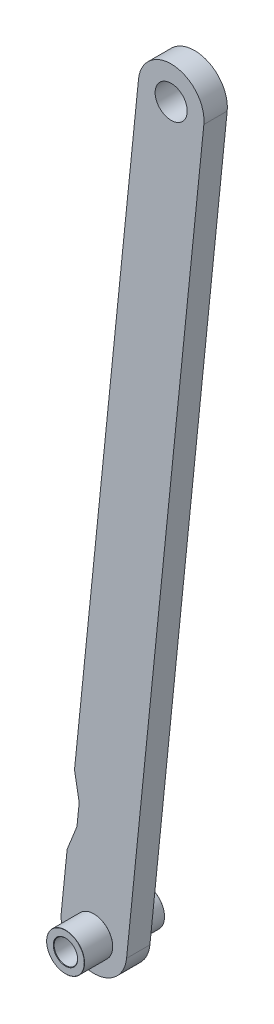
ISO-10303-21;
HEADER;
FILE_DESCRIPTION(('STEP AP214'),'2;1');
FILE_NAME('part.step','',(''),(''),'','','');
FILE_SCHEMA(('AUTOMOTIVE_DESIGN { 1 0 10303 214 1 1 1 1 }'));
ENDSEC;
DATA;
#1=APPLICATION_CONTEXT('core data for automotive mechanical design processes');
#2=APPLICATION_PROTOCOL_DEFINITION('international standard','automotive_design',2000,#1);
#3=PRODUCT_CONTEXT('',#1,'mechanical');
#4=PRODUCT('Part','Part','',(#3));
#5=PRODUCT_RELATED_PRODUCT_CATEGORY('part','',(#4));
#6=PRODUCT_DEFINITION_FORMATION('','',#4);
#7=PRODUCT_DEFINITION_CONTEXT('part definition',#1,'design');
#8=PRODUCT_DEFINITION('design','',#6,#7);
#9=PRODUCT_DEFINITION_SHAPE('','',#8);
#10=(LENGTH_UNIT() NAMED_UNIT(*) SI_UNIT(.MILLI.,.METRE.));
#11=(NAMED_UNIT(*) PLANE_ANGLE_UNIT() SI_UNIT($,.RADIAN.));
#12=(NAMED_UNIT(*) SI_UNIT($,.STERADIAN.) SOLID_ANGLE_UNIT());
#13=UNCERTAINTY_MEASURE_WITH_UNIT(LENGTH_MEASURE(1.E-05),#10,'distance_accuracy_value','');
#14=(GEOMETRIC_REPRESENTATION_CONTEXT(3) GLOBAL_UNCERTAINTY_ASSIGNED_CONTEXT((#13)) GLOBAL_UNIT_ASSIGNED_CONTEXT((#10,
#11,#12)) REPRESENTATION_CONTEXT('',''));
#15=CARTESIAN_POINT('',(0.,0.,0.));
#16=DIRECTION('',(0.,0.,1.));
#17=DIRECTION('',(1.,0.,0.));
#18=AXIS2_PLACEMENT_3D('',#15,#16,#17);
#19=CARTESIAN_POINT('',(118.610253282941,-532.968700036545,-27.5000000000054));
#20=DIRECTION('',(0.,0.,-1.));
#21=DIRECTION('',(-0.0840710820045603,0.996459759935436,0.));
#22=AXIS2_PLACEMENT_3D('',#19,#20,#21);
#23=PLANE('',#22);
#24=CARTESIAN_POINT('',(118.610253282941,-532.968700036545,-27.5000000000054));
#25=DIRECTION('',(0.,0.,-1.));
#26=DIRECTION('',(-0.0840710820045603,0.996459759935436,0.));
#27=AXIS2_PLACEMENT_3D('',#24,#25,#26);
#28=CIRCLE('',#27,12.9);
#29=CARTESIAN_POINT('',(117.525736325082,-520.114369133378,-27.5000000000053));
#30=VERTEX_POINT('',#29);
#31=EDGE_CURVE('P0_E10',#30,#30,#28,.T.);
#32=ORIENTED_EDGE('',*,*,#31,.T.);
#33=EDGE_LOOP('',(#32));
#34=FACE_BOUND('',#33,.T.);
#35=CARTESIAN_POINT('',(118.610253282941,-532.968700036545,-27.5000000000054));
#36=DIRECTION('',(0.,0.,-1.));
#37=DIRECTION('',(-0.0840710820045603,0.996459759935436,0.));
#38=AXIS2_PLACEMENT_3D('',#35,#36,#37);
#39=CIRCLE('',#38,8.35);
#40=CARTESIAN_POINT('',(117.908259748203,-524.648261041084,-27.5000000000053));
#41=VERTEX_POINT('',#40);
#42=EDGE_CURVE('P0_E34',#41,#41,#39,.F.);
#43=ORIENTED_EDGE('',*,*,#42,.T.);
#44=EDGE_LOOP('',(#43));
#45=FACE_BOUND('',#44,.T.);
#46=ADVANCED_FACE('P0_F14',(#34,#45),#23,.T.);
#47=CARTESIAN_POINT('',(118.610253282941,-532.968700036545,-8.0000000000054));
#48=DIRECTION('',(0.,0.,-1.));
#49=DIRECTION('',(-0.0840710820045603,0.996459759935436,0.));
#50=AXIS2_PLACEMENT_3D('',#47,#48,#49);
#51=PLANE('',#50);
#52=CARTESIAN_POINT('',(118.610253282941,-532.968700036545,-8.0000000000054));
#53=DIRECTION('',(0.,0.,-1.));
#54=DIRECTION('',(-0.0840710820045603,0.996459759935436,0.));
#55=AXIS2_PLACEMENT_3D('',#52,#53,#54);
#56=CIRCLE('',#55,12.9);
#57=CARTESIAN_POINT('',(117.525736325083,-520.114369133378,-8.0000000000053));
#58=VERTEX_POINT('',#57);
#59=EDGE_CURVE('P0_E21',#58,#58,#56,.F.);
#60=ORIENTED_EDGE('',*,*,#59,.T.);
#61=EDGE_LOOP('',(#60));
#62=FACE_BOUND('',#61,.T.);
#63=CARTESIAN_POINT('',(118.610253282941,-532.968700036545,-8.0000000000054));
#64=DIRECTION('',(0.,0.,-1.));
#65=DIRECTION('',(-0.0840710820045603,0.996459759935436,0.));
#66=AXIS2_PLACEMENT_3D('',#63,#64,#65);
#67=CIRCLE('',#66,8.35);
#68=CARTESIAN_POINT('',(119.31224681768,-541.289139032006,-8.00000000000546));
#69=VERTEX_POINT('',#68);
#70=EDGE_CURVE('P0_E43',#69,#69,#67,.T.);
#71=ORIENTED_EDGE('',*,*,#70,.T.);
#72=EDGE_LOOP('',(#71));
#73=FACE_BOUND('',#72,.T.);
#74=ADVANCED_FACE('P0_F47',(#62,#73),#51,.F.);
#75=CARTESIAN_POINT('',(118.610253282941,-532.968700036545,-27.5000000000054));
#76=DIRECTION('',(0.,0.,1.));
#77=DIRECTION('',(0.0840710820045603,-0.996459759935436,0.));
#78=AXIS2_PLACEMENT_3D('',#75,#76,#77);
#79=CYLINDRICAL_SURFACE('',#78,13.);
#80=CARTESIAN_POINT('',(118.610253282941,-532.968700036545,-8.1000000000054));
#81=DIRECTION('',(0.,0.,-1.));
#82=DIRECTION('',(-0.0840710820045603,0.996459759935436,0.));
#83=AXIS2_PLACEMENT_3D('',#80,#81,#82);
#84=CIRCLE('',#83,13.);
#85=CARTESIAN_POINT('',(117.517329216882,-520.014723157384,-8.1000000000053));
#86=VERTEX_POINT('',#85);
#87=EDGE_CURVE('P0_E25',#86,#86,#84,.T.);
#88=ORIENTED_EDGE('',*,*,#87,.T.);
#89=EDGE_LOOP('',(#88));
#90=FACE_BOUND('',#89,.T.);
#91=CARTESIAN_POINT('',(118.610253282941,-532.968700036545,-27.4000000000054));
#92=DIRECTION('',(0.,0.,-1.));
#93=DIRECTION('',(-0.0840710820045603,0.996459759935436,0.));
#94=AXIS2_PLACEMENT_3D('',#91,#92,#93);
#95=CIRCLE('',#94,13.);
#96=CARTESIAN_POINT('',(117.517329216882,-520.014723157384,-27.4000000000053));
#97=VERTEX_POINT('',#96);
#98=EDGE_CURVE('P0_E29',#97,#97,#95,.F.);
#99=ORIENTED_EDGE('',*,*,#98,.T.);
#100=EDGE_LOOP('',(#99));
#101=FACE_BOUND('',#100,.T.);
#102=ADVANCED_FACE('P0_F63',(#90,#101),#79,.T.);
#103=CARTESIAN_POINT('',(118.610253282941,-532.968700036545,-27.5000000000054));
#104=DIRECTION('',(0.,0.,1.));
#105=DIRECTION('',(0.0840710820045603,-0.996459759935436,0.));
#106=AXIS2_PLACEMENT_3D('',#103,#104,#105);
#107=CYLINDRICAL_SURFACE('',#106,8.05);
#108=CARTESIAN_POINT('',(118.610253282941,-532.968700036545,-8.3000000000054));
#109=DIRECTION('',(0.,0.,-1.));
#110=DIRECTION('',(-0.0840710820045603,0.996459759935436,0.));
#111=AXIS2_PLACEMENT_3D('',#108,#109,#110);
#112=CIRCLE('',#111,8.05);
#113=CARTESIAN_POINT('',(119.287025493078,-540.990201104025,-8.30000000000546));
#114=VERTEX_POINT('',#113);
#115=EDGE_CURVE('P0_E37',#114,#114,#112,.F.);
#116=ORIENTED_EDGE('',*,*,#115,.T.);
#117=EDGE_LOOP('',(#116));
#118=FACE_BOUND('',#117,.T.);
#119=CARTESIAN_POINT('',(118.610253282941,-532.968700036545,-27.2000000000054));
#120=DIRECTION('',(0.,0.,-1.));
#121=DIRECTION('',(-0.0840710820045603,0.996459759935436,0.));
#122=AXIS2_PLACEMENT_3D('',#119,#120,#121);
#123=CIRCLE('',#122,8.05);
#124=CARTESIAN_POINT('',(117.933481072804,-524.947198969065,-27.2000000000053));
#125=VERTEX_POINT('',#124);
#126=EDGE_CURVE('P0_E40',#125,#125,#123,.T.);
#127=ORIENTED_EDGE('',*,*,#126,.T.);
#128=EDGE_LOOP('',(#127));
#129=FACE_BOUND('',#128,.T.);
#130=ADVANCED_FACE('P0_F52',(#118,#129),#107,.F.);
#131=CARTESIAN_POINT('',(118.610253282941,-532.968700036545,-8.0000000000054));
#132=DIRECTION('',(0.,0.,1.));
#133=DIRECTION('',(0.0840710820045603,-0.996459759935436,0.));
#134=AXIS2_PLACEMENT_3D('',#131,#132,#133);
#135=CONICAL_SURFACE('',#134,8.35,0.785398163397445);
#136=CARTESIAN_POINT('',(119.287025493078,-540.990201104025,-8.30000000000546));
#137=CARTESIAN_POINT('',(119.287288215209,-540.993315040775,-8.29687500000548));
#138=CARTESIAN_POINT('',(119.287550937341,-540.996428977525,-8.29375000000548));
#139=CARTESIAN_POINT('',(119.288076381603,-541.002656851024,-8.28750000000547));
#140=CARTESIAN_POINT('',(119.288339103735,-541.005770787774,-8.28437500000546));
#141=CARTESIAN_POINT('',(119.288864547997,-541.011998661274,-8.27812500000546));
#142=CARTESIAN_POINT('',(119.289127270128,-541.015112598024,-8.27500000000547));
#143=CARTESIAN_POINT('',(119.289652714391,-541.021340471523,-8.26875000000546));
#144=CARTESIAN_POINT('',(119.289915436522,-541.024454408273,-8.26562500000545));
#145=CARTESIAN_POINT('',(119.290440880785,-541.030682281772,-8.25937500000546));
#146=CARTESIAN_POINT('',(119.290703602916,-541.033796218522,-8.25625000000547));
#147=CARTESIAN_POINT('',(119.291229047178,-541.040024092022,-8.25000000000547));
#148=CARTESIAN_POINT('',(119.29149176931,-541.043138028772,-8.24687500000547));
#149=CARTESIAN_POINT('',(119.292017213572,-541.049365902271,-8.24062500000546));
#150=CARTESIAN_POINT('',(119.292279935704,-541.052479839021,-8.23750000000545));
#151=CARTESIAN_POINT('',(119.292805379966,-541.058707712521,-8.23125000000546));
#152=CARTESIAN_POINT('',(119.293068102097,-541.061821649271,-8.22812500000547));
#153=CARTESIAN_POINT('',(119.29359354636,-541.06804952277,-8.22187500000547));
#154=CARTESIAN_POINT('',(119.293856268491,-541.07116345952,-8.21875000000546));
#155=CARTESIAN_POINT('',(119.294381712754,-541.077391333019,-8.21250000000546));
#156=CARTESIAN_POINT('',(119.294644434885,-541.080505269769,-8.20937500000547));
#157=CARTESIAN_POINT('',(119.295169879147,-541.086733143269,-8.20312500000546));
#158=CARTESIAN_POINT('',(119.295432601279,-541.089847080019,-8.20000000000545));
#159=CARTESIAN_POINT('',(119.295958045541,-541.096074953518,-8.19375000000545));
#160=CARTESIAN_POINT('',(119.296220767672,-541.099188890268,-8.19062500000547));
#161=CARTESIAN_POINT('',(119.296746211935,-541.105416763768,-8.18437500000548));
#162=CARTESIAN_POINT('',(119.297008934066,-541.108530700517,-8.18125000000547));
#163=CARTESIAN_POINT('',(119.297534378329,-541.114758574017,-8.17500000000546));
#164=CARTESIAN_POINT('',(119.29779710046,-541.117872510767,-8.17187500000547));
#165=CARTESIAN_POINT('',(119.298322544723,-541.124100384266,-8.16562500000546));
#166=CARTESIAN_POINT('',(119.298585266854,-541.127214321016,-8.16250000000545));
#167=CARTESIAN_POINT('',(119.299110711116,-541.133442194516,-8.15625000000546));
#168=CARTESIAN_POINT('',(119.299373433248,-541.136556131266,-8.15312500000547));
#169=CARTESIAN_POINT('',(119.29989887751,-541.142784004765,-8.14687500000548));
#170=CARTESIAN_POINT('',(119.300161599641,-541.145897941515,-8.14375000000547));
#171=CARTESIAN_POINT('',(119.300687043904,-541.152125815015,-8.13750000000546));
#172=CARTESIAN_POINT('',(119.300949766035,-541.155239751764,-8.13437500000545));
#173=CARTESIAN_POINT('',(119.301475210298,-541.161467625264,-8.12812500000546));
#174=CARTESIAN_POINT('',(119.301737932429,-541.164581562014,-8.12500000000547));
#175=CARTESIAN_POINT('',(119.302263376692,-541.170809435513,-8.11875000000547));
#176=CARTESIAN_POINT('',(119.302526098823,-541.173923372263,-8.11562500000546));
#177=CARTESIAN_POINT('',(119.303051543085,-541.180151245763,-8.10937500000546));
#178=CARTESIAN_POINT('',(119.303314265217,-541.183265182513,-8.10625000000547));
#179=CARTESIAN_POINT('',(119.303839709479,-541.189493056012,-8.10000000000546));
#180=CARTESIAN_POINT('',(119.30410243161,-541.192606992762,-8.09687500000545));
#181=CARTESIAN_POINT('',(119.304627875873,-541.198834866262,-8.09062500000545));
#182=CARTESIAN_POINT('',(119.304890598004,-541.201948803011,-8.08750000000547));
#183=CARTESIAN_POINT('',(119.305416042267,-541.208176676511,-8.08125000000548));
#184=CARTESIAN_POINT('',(119.305678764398,-541.211290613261,-8.07812500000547));
#185=CARTESIAN_POINT('',(119.306204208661,-541.21751848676,-8.07187500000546));
#186=CARTESIAN_POINT('',(119.306466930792,-541.22063242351,-8.06875000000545));
#187=CARTESIAN_POINT('',(119.306992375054,-541.22686029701,-8.06250000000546));
#188=CARTESIAN_POINT('',(119.307255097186,-541.22997423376,-8.05937500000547));
#189=CARTESIAN_POINT('',(119.307780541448,-541.236202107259,-8.05312500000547));
#190=CARTESIAN_POINT('',(119.308043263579,-541.239316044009,-8.05000000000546));
#191=CARTESIAN_POINT('',(119.308568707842,-541.245543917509,-8.04375000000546));
#192=CARTESIAN_POINT('',(119.308831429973,-541.248657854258,-8.04062500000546));
#193=CARTESIAN_POINT('',(119.309356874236,-541.254885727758,-8.03437500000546));
#194=CARTESIAN_POINT('',(119.309619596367,-541.257999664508,-8.03125000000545));
#195=CARTESIAN_POINT('',(119.310145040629,-541.264227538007,-8.02500000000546));
#196=CARTESIAN_POINT('',(119.310407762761,-541.267341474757,-8.02187500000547));
#197=CARTESIAN_POINT('',(119.310933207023,-541.273569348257,-8.01562500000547));
#198=CARTESIAN_POINT('',(119.311195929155,-541.276683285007,-8.01250000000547));
#199=CARTESIAN_POINT('',(119.311721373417,-541.282911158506,-8.00625000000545));
#200=CARTESIAN_POINT('',(119.311984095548,-541.286025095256,-8.00312500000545));
#201=CARTESIAN_POINT('',(119.31224681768,-541.289139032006,-8.00000000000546));
#202=B_SPLINE_CURVE_WITH_KNOTS('',3,(#136,#137,#138,#139,#140,#141,#142,#143,#144,#145,#146,
#147,#148,#149,#150,#151,#152,#153,#154,#155,#156,#157,#158,#159,#160,#161,#162,#163,#164,#165,
#166,#167,#168,#169,#170,#171,#172,#173,#174,#175,#176,#177,#178,#179,#180,#181,#182,#183,#184,
#185,#186,#187,#188,#189,#190,#191,#192,#193,#194,#195,#196,#197,#198,#199,#200,#201),
.UNSPECIFIED.,.F.,.F.,(4,2,2,2,2,2,2,2,2,2,2,2,2,2,2,2,2,2,2,2,2,2,2,2,2,2,2,2,2,2,2,2,4),(0.,
0.0132582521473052,0.0265165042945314,0.0397747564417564,0.0530330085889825,0.0662912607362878,
0.0795495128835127,0.0928077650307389,0.106066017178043,0.119324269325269,0.132582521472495,
0.145840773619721,0.159099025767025,0.17235727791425,0.185615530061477,0.198873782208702,
0.212132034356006,0.225390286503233,0.238648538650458,0.251906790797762,0.265165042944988,
0.278423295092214,0.29168154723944,0.304939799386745,0.31819805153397,0.331456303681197,
0.344714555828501,0.357972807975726,0.371231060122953,0.384489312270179,0.397747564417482,
0.411005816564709,0.424264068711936),.UNSPECIFIED.);
#203=EDGE_CURVE('P0_BSEAM49',#114,#69,#202,.T.);
#204=ORIENTED_EDGE('',*,*,#115,.F.);
#205=ORIENTED_EDGE('',*,*,#70,.F.);
#206=ORIENTED_EDGE('',*,*,#203,.T.);
#207=ORIENTED_EDGE('',*,*,#203,.F.);
#208=EDGE_LOOP('',(#204,#206,#205,#207));
#209=FACE_BOUND('',#208,.T.);
#210=ADVANCED_FACE('P0_F49',(#209),#135,.F.);
#211=CARTESIAN_POINT('',(118.610253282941,-532.968700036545,-27.2000000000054));
#212=DIRECTION('',(0.,0.,-1.));
#213=DIRECTION('',(-0.0840710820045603,0.996459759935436,0.));
#214=AXIS2_PLACEMENT_3D('',#211,#212,#213);
#215=CONICAL_SURFACE('',#214,8.05,0.785398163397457);
#216=ORIENTED_EDGE('',*,*,#42,.F.);
#217=EDGE_LOOP('',(#216));
#218=FACE_BOUND('',#217,.T.);
#219=ORIENTED_EDGE('',*,*,#126,.F.);
#220=EDGE_LOOP('',(#219));
#221=FACE_BOUND('',#220,.T.);
#222=ADVANCED_FACE('P0_F51',(#218,#221),#215,.F.);
#223=CARTESIAN_POINT('',(118.610253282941,-532.968700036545,-8.1000000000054));
#224=DIRECTION('',(0.,0.,-1.));
#225=DIRECTION('',(-0.0840710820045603,0.996459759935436,0.));
#226=AXIS2_PLACEMENT_3D('',#223,#224,#225);
#227=CONICAL_SURFACE('',#226,13.,0.785398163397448);
#228=ORIENTED_EDGE('',*,*,#59,.F.);
#229=EDGE_LOOP('',(#228));
#230=FACE_BOUND('',#229,.T.);
#231=ORIENTED_EDGE('',*,*,#87,.F.);
#232=EDGE_LOOP('',(#231));
#233=FACE_BOUND('',#232,.T.);
#234=ADVANCED_FACE('P0_F60',(#230,#233),#227,.T.);
#235=CARTESIAN_POINT('',(118.610253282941,-532.968700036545,-27.5000000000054));
#236=DIRECTION('',(0.,0.,1.));
#237=DIRECTION('',(0.0840710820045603,-0.996459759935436,0.));
#238=AXIS2_PLACEMENT_3D('',#235,#236,#237);
#239=CONICAL_SURFACE('',#238,12.9,0.785398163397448);
#240=ORIENTED_EDGE('',*,*,#98,.F.);
#241=EDGE_LOOP('',(#240));
#242=FACE_BOUND('',#241,.T.);
#243=ORIENTED_EDGE('',*,*,#31,.F.);
#244=EDGE_LOOP('',(#243));
#245=FACE_BOUND('',#244,.T.);
#246=ADVANCED_FACE('P0_F16',(#242,#245),#239,.T.);
#247=CLOSED_SHELL('',(#46,#74,#102,#130,#210,#222,#234,#246));
#248=MANIFOLD_SOLID_BREP('P0_B1',#247);
#249=CARTESIAN_POINT('',(171.564170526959,-11.651251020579,-8.00000000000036));
#250=DIRECTION('',(0.,0.,-1.));
#251=DIRECTION('',(-0.101057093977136,-0.994880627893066,0.));
#252=AXIS2_PLACEMENT_3D('',#249,#250,#251);
#253=PLANE('',#252);
#254=CARTESIAN_POINT('',(118.61025328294,-532.968700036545,-8.00000000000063));
#255=DIRECTION('',(0.,0.,-1.));
#256=DIRECTION('',(-0.101057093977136,-0.994880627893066,0.));
#257=AXIS2_PLACEMENT_3D('',#254,#255,#256);
#258=CIRCLE('',#257,11.);
#259=CARTESIAN_POINT('',(117.498625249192,-543.912386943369,-8.00000000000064));
#260=VERTEX_POINT('',#259);
#261=EDGE_CURVE('P1_E142',#260,#260,#258,.T.);
#262=ORIENTED_EDGE('',*,*,#261,.F.);
#263=EDGE_LOOP('',(#262));
#264=FACE_BOUND('',#263,.T.);
#265=CARTESIAN_POINT('',(171.564170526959,-11.651251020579,-8.00000000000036));
#266=DIRECTION('',(0.,0.,-1.));
#267=DIRECTION('',(-0.101057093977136,-0.994880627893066,0.));
#268=AXIS2_PLACEMENT_3D('',#265,#266,#267);
#269=CIRCLE('',#268,11.);
#270=CARTESIAN_POINT('',(170.452542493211,-22.5949379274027,-8.00000000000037));
#271=VERTEX_POINT('',#270);
#272=EDGE_CURVE('P1_E136',#271,#271,#269,.T.);
#273=ORIENTED_EDGE('',*,*,#272,.F.);
#274=EDGE_LOOP('',(#273));
#275=FACE_BOUND('',#274,.T.);
#276=DIRECTION('',(0.101057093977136,0.994880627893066,0.));
#277=VECTOR('',#276,1.);
#278=CARTESIAN_POINT('',(149.179356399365,-9.37746640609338,-8.00000000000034));
#279=LINE('',#278,#277);
#280=CARTESIAN_POINT('',(96.2254391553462,-530.69491542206,-8.00000000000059));
#281=VERTEX_POINT('',#280);
#282=CARTESIAN_POINT('',(100.267722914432,-490.899690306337,-8.00000000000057));
#283=VERTEX_POINT('',#282);
#284=EDGE_CURVE('P1_E115',#281,#283,#279,.T.);
#285=ORIENTED_EDGE('',*,*,#284,.T.);
#286=DIRECTION('',(0.37048354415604,0.928839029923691,0.));
#287=VECTOR('',#286,1.);
#288=CARTESIAN_POINT('',(274.972504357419,-52.8974570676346,-8.00000000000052));
#289=LINE('',#288,#287);
#290=CARTESIAN_POINT('',(107.010625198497,-473.994564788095,-8.00000000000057));
#291=VERTEX_POINT('',#290);
#292=EDGE_CURVE('P1_E31',#283,#291,#289,.T.);
#293=ORIENTED_EDGE('',*,*,#292,.T.);
#294=DIRECTION('',(0.101057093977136,0.994880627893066,0.));
#295=VECTOR('',#294,1.);
#296=CARTESIAN_POINT('',(154.153759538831,-9.88275187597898,-8.00000000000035));
#297=LINE('',#296,#295);
#298=CARTESIAN_POINT('',(108.526481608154,-459.071355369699,-8.00000000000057));
#299=VERTEX_POINT('',#298);
#300=EDGE_CURVE('P1_E35',#291,#299,#297,.T.);
#301=ORIENTED_EDGE('',*,*,#300,.T.);
#302=DIRECTION('',(-0.17614591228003,0.984364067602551,0.));
#303=VECTOR('',#302,1.);
#304=CARTESIAN_POINT('',(32.9034405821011,-36.4637381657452,-8.0000000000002));
#305=LINE('',#304,#303);
#306=CARTESIAN_POINT('',(105.320577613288,-441.155658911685,-8.00000000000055));
#307=VERTEX_POINT('',#306);
#308=EDGE_CURVE('P1_E147',#299,#307,#305,.T.);
#309=ORIENTED_EDGE('',*,*,#308,.T.);
#310=CARTESIAN_POINT('',(149.179356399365,-9.37746640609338,-8.00000000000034));
#311=VERTEX_POINT('',#310);
#312=EDGE_CURVE('P1_E96',#307,#311,#279,.T.);
#313=ORIENTED_EDGE('',*,*,#312,.T.);
#314=CARTESIAN_POINT('',(171.564170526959,-11.651251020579,-8.00000000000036));
#315=DIRECTION('',(0.,0.,-1.));
#316=DIRECTION('',(-0.101057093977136,-0.994880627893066,0.));
#317=AXIS2_PLACEMENT_3D('',#314,#315,#316);
#318=CIRCLE('',#317,22.5);
#319=CARTESIAN_POINT('',(193.948984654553,-13.9250356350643,-8.0000000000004));
#320=VERTEX_POINT('',#319);
#321=EDGE_CURVE('P1_E123',#311,#320,#318,.T.);
#322=ORIENTED_EDGE('',*,*,#321,.T.);
#323=DIRECTION('',(-0.101057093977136,-0.994880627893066,0.));
#324=VECTOR('',#323,1.);
#325=CARTESIAN_POINT('',(140.995067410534,-535.242484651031,-8.00000000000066));
#326=LINE('',#325,#324);
#327=CARTESIAN_POINT('',(140.995067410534,-535.242484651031,-8.00000000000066));
#328=VERTEX_POINT('',#327);
#329=EDGE_CURVE('P1_E120',#320,#328,#326,.T.);
#330=ORIENTED_EDGE('',*,*,#329,.T.);
#331=CARTESIAN_POINT('',(118.61025328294,-532.968700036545,-8.00000000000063));
#332=DIRECTION('',(0.,0.,-1.));
#333=DIRECTION('',(-0.101057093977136,-0.994880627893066,0.));
#334=AXIS2_PLACEMENT_3D('',#331,#332,#333);
#335=CIRCLE('',#334,22.5);
#336=EDGE_CURVE('P1_E117',#328,#281,#335,.T.);
#337=ORIENTED_EDGE('',*,*,#336,.T.);
#338=EDGE_LOOP('',(#285,#293,#301,#309,#313,#322,#330,#337));
#339=FACE_BOUND('',#338,.T.);
#340=ADVANCED_FACE('P1_F16',(#264,#275,#339),#253,.T.);
#341=CARTESIAN_POINT('',(149.179356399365,-9.37746640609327,7.99999999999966));
#342=DIRECTION('',(-0.994880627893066,0.101057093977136,0.));
#343=DIRECTION('',(0.101057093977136,0.994880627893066,0.));
#344=AXIS2_PLACEMENT_3D('',#341,#342,#343);
#345=PLANE('',#344);
#346=DIRECTION('',(0.101057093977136,0.994880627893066,0.));
#347=VECTOR('',#346,1.);
#348=CARTESIAN_POINT('',(149.179356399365,-9.37746640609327,7.99999999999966));
#349=LINE('',#348,#347);
#350=CARTESIAN_POINT('',(96.2254391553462,-530.69491542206,7.99999999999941));
#351=VERTEX_POINT('',#350);
#352=CARTESIAN_POINT('',(100.267722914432,-490.899690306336,7.99999999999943));
#353=VERTEX_POINT('',#352);
#354=EDGE_CURVE('P1_E89',#351,#353,#349,.T.);
#355=ORIENTED_EDGE('',*,*,#354,.T.);
#356=DIRECTION('',(0.,0.,-1.));
#357=VECTOR('',#356,1.);
#358=CARTESIAN_POINT('',(100.267722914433,-490.899690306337,741.751094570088));
#359=LINE('',#358,#357);
#360=EDGE_CURVE('P1_E149',#353,#283,#359,.T.);
#361=ORIENTED_EDGE('',*,*,#360,.T.);
#362=ORIENTED_EDGE('',*,*,#284,.F.);
#363=DIRECTION('',(0.,0.,-1.));
#364=VECTOR('',#363,1.);
#365=CARTESIAN_POINT('',(96.2254391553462,-530.69491542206,7.99999999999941));
#366=LINE('',#365,#364);
#367=EDGE_CURVE('P1_E106',#351,#281,#366,.T.);
#368=ORIENTED_EDGE('',*,*,#367,.F.);
#369=EDGE_LOOP('',(#355,#361,#362,#368));
#370=FACE_BOUND('',#369,.T.);
#371=ADVANCED_FACE('P1_F162',(#370),#345,.T.);
#372=ORIENTED_EDGE('',*,*,#312,.F.);
#373=DIRECTION('',(0.,0.,-1.));
#374=VECTOR('',#373,1.);
#375=CARTESIAN_POINT('',(105.320577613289,-441.155658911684,741.751094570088));
#376=LINE('',#375,#374);
#377=CARTESIAN_POINT('',(105.320577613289,-441.155658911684,7.99999999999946));
#378=VERTEX_POINT('',#377);
#379=EDGE_CURVE('P1_E94',#378,#307,#376,.T.);
#380=ORIENTED_EDGE('',*,*,#379,.F.);
#381=CARTESIAN_POINT('',(149.179356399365,-9.37746640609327,7.99999999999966));
#382=VERTEX_POINT('',#381);
#383=EDGE_CURVE('P1_E79',#378,#382,#349,.T.);
#384=ORIENTED_EDGE('',*,*,#383,.T.);
#385=DIRECTION('',(0.,0.,-1.));
#386=VECTOR('',#385,1.);
#387=CARTESIAN_POINT('',(149.179356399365,-9.37746640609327,7.99999999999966));
#388=LINE('',#387,#386);
#389=EDGE_CURVE('P1_E104',#382,#311,#388,.T.);
#390=ORIENTED_EDGE('',*,*,#389,.T.);
#391=EDGE_LOOP('',(#372,#380,#384,#390));
#392=FACE_BOUND('',#391,.T.);
#393=ADVANCED_FACE('P1_F95',(#392),#345,.T.);
#394=CARTESIAN_POINT('',(171.564170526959,-11.6512510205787,7.99999999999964));
#395=DIRECTION('',(0.,0.,-1.));
#396=DIRECTION('',(-0.101057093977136,-0.994880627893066,0.));
#397=AXIS2_PLACEMENT_3D('',#394,#395,#396);
#398=PLANE('',#397);
#399=CARTESIAN_POINT('',(171.564170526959,-11.6512510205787,7.99999999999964));
#400=DIRECTION('',(0.,0.,-1.));
#401=DIRECTION('',(-0.101057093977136,-0.994880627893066,0.));
#402=AXIS2_PLACEMENT_3D('',#399,#400,#401);
#403=CIRCLE('',#402,11.);
#404=CARTESIAN_POINT('',(170.452542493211,-22.5949379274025,7.99999999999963));
#405=VERTEX_POINT('',#404);
#406=EDGE_CURVE('P1_E125',#405,#405,#403,.T.);
#407=ORIENTED_EDGE('',*,*,#406,.T.);
#408=EDGE_LOOP('',(#407));
#409=FACE_BOUND('',#408,.T.);
#410=CARTESIAN_POINT('',(118.61025328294,-532.968700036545,7.99999999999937));
#411=DIRECTION('',(0.,0.,-1.));
#412=DIRECTION('',(-0.101057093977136,-0.994880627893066,0.));
#413=AXIS2_PLACEMENT_3D('',#410,#411,#412);
#414=CIRCLE('',#413,11.);
#415=CARTESIAN_POINT('',(117.498625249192,-543.912386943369,7.99999999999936));
#416=VERTEX_POINT('',#415);
#417=EDGE_CURVE('P1_E139',#416,#416,#414,.T.);
#418=ORIENTED_EDGE('',*,*,#417,.T.);
#419=EDGE_LOOP('',(#418));
#420=FACE_BOUND('',#419,.T.);
#421=DIRECTION('',(0.37048354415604,0.928839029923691,0.));
#422=VECTOR('',#421,1.);
#423=CARTESIAN_POINT('',(274.972504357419,-52.897457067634,7.99999999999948));
#424=LINE('',#423,#422);
#425=CARTESIAN_POINT('',(107.010625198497,-473.994564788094,7.99999999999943));
#426=VERTEX_POINT('',#425);
#427=EDGE_CURVE('P1_E11',#353,#426,#424,.T.);
#428=ORIENTED_EDGE('',*,*,#427,.F.);
#429=ORIENTED_EDGE('',*,*,#354,.F.);
#430=CARTESIAN_POINT('',(118.61025328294,-532.968700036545,7.99999999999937));
#431=DIRECTION('',(0.,0.,-1.));
#432=DIRECTION('',(-0.101057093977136,-0.994880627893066,0.));
#433=AXIS2_PLACEMENT_3D('',#430,#431,#432);
#434=CIRCLE('',#433,22.5);
#435=CARTESIAN_POINT('',(140.995067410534,-535.242484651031,7.99999999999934));
#436=VERTEX_POINT('',#435);
#437=EDGE_CURVE('P1_E90',#436,#351,#434,.T.);
#438=ORIENTED_EDGE('',*,*,#437,.F.);
#439=DIRECTION('',(-0.101057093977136,-0.994880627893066,0.));
#440=VECTOR('',#439,1.);
#441=CARTESIAN_POINT('',(140.995067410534,-535.242484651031,7.99999999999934));
#442=LINE('',#441,#440);
#443=CARTESIAN_POINT('',(193.948984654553,-13.9250356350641,7.9999999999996));
#444=VERTEX_POINT('',#443);
#445=EDGE_CURVE('P1_E130',#444,#436,#442,.T.);
#446=ORIENTED_EDGE('',*,*,#445,.F.);
#447=CARTESIAN_POINT('',(171.564170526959,-11.6512510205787,7.99999999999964));
#448=DIRECTION('',(0.,0.,-1.));
#449=DIRECTION('',(-0.101057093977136,-0.994880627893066,0.));
#450=AXIS2_PLACEMENT_3D('',#447,#448,#449);
#451=CIRCLE('',#450,22.5);
#452=EDGE_CURVE('P1_E85',#382,#444,#451,.T.);
#453=ORIENTED_EDGE('',*,*,#452,.F.);
#454=ORIENTED_EDGE('',*,*,#383,.F.);
#455=DIRECTION('',(-0.17614591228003,0.984364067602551,0.));
#456=VECTOR('',#455,1.);
#457=CARTESIAN_POINT('',(32.9034405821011,-36.4637381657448,7.9999999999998));
#458=LINE('',#457,#456);
#459=CARTESIAN_POINT('',(108.526481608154,-459.071355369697,7.99999999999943));
#460=VERTEX_POINT('',#459);
#461=EDGE_CURVE('P1_E82',#460,#378,#458,.T.);
#462=ORIENTED_EDGE('',*,*,#461,.F.);
#463=DIRECTION('',(0.101057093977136,0.994880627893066,0.));
#464=VECTOR('',#463,1.);
#465=CARTESIAN_POINT('',(154.153759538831,-9.88275187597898,7.99999999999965));
#466=LINE('',#465,#464);
#467=EDGE_CURVE('P1_E24',#426,#460,#466,.T.);
#468=ORIENTED_EDGE('',*,*,#467,.F.);
#469=EDGE_LOOP('',(#428,#429,#438,#446,#453,#454,#462,#468));
#470=FACE_BOUND('',#469,.T.);
#471=ADVANCED_FACE('P1_F18',(#409,#420,#470),#398,.F.);
#472=CARTESIAN_POINT('',(171.564170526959,-11.6512510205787,7.99999999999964));
#473=DIRECTION('',(0.,0.,-1.));
#474=DIRECTION('',(-0.101057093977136,-0.994880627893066,0.));
#475=AXIS2_PLACEMENT_3D('',#472,#473,#474);
#476=CYLINDRICAL_SURFACE('',#475,22.5);
#477=ORIENTED_EDGE('',*,*,#321,.F.);
#478=ORIENTED_EDGE('',*,*,#389,.F.);
#479=ORIENTED_EDGE('',*,*,#452,.T.);
#480=DIRECTION('',(0.,0.,-1.));
#481=VECTOR('',#480,1.);
#482=CARTESIAN_POINT('',(193.948984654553,-13.9250356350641,7.9999999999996));
#483=LINE('',#482,#481);
#484=EDGE_CURVE('P1_E109',#444,#320,#483,.T.);
#485=ORIENTED_EDGE('',*,*,#484,.T.);
#486=EDGE_LOOP('',(#477,#478,#479,#485));
#487=FACE_BOUND('',#486,.T.);
#488=ADVANCED_FACE('P1_F172',(#487),#476,.T.);
#489=CARTESIAN_POINT('',(118.61025328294,-532.968700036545,7.99999999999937));
#490=DIRECTION('',(0.,0.,-1.));
#491=DIRECTION('',(-0.101057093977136,-0.994880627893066,0.));
#492=AXIS2_PLACEMENT_3D('',#489,#490,#491);
#493=CYLINDRICAL_SURFACE('',#492,22.5);
#494=ORIENTED_EDGE('',*,*,#336,.F.);
#495=DIRECTION('',(0.,0.,-1.));
#496=VECTOR('',#495,1.);
#497=CARTESIAN_POINT('',(140.995067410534,-535.242484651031,7.99999999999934));
#498=LINE('',#497,#496);
#499=EDGE_CURVE('P1_E111',#436,#328,#498,.T.);
#500=ORIENTED_EDGE('',*,*,#499,.F.);
#501=ORIENTED_EDGE('',*,*,#437,.T.);
#502=ORIENTED_EDGE('',*,*,#367,.T.);
#503=EDGE_LOOP('',(#494,#500,#501,#502));
#504=FACE_BOUND('',#503,.T.);
#505=ADVANCED_FACE('P1_F165',(#504),#493,.T.);
#506=CARTESIAN_POINT('',(140.995067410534,-535.242484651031,7.99999999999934));
#507=DIRECTION('',(0.994880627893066,-0.101057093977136,0.));
#508=DIRECTION('',(-0.101057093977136,-0.994880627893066,0.));
#509=AXIS2_PLACEMENT_3D('',#506,#507,#508);
#510=PLANE('',#509);
#511=ORIENTED_EDGE('',*,*,#329,.F.);
#512=ORIENTED_EDGE('',*,*,#484,.F.);
#513=ORIENTED_EDGE('',*,*,#445,.T.);
#514=ORIENTED_EDGE('',*,*,#499,.T.);
#515=EDGE_LOOP('',(#511,#512,#513,#514));
#516=FACE_BOUND('',#515,.T.);
#517=ADVANCED_FACE('P1_F167',(#516),#510,.T.);
#518=CARTESIAN_POINT('',(171.564170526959,-11.651251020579,-8.00000000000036));
#519=DIRECTION('',(0.,0.,-1.));
#520=DIRECTION('',(-0.101057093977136,-0.994880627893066,0.));
#521=AXIS2_PLACEMENT_3D('',#518,#519,#520);
#522=CYLINDRICAL_SURFACE('',#521,11.);
#523=ORIENTED_EDGE('',*,*,#406,.F.);
#524=EDGE_LOOP('',(#523));
#525=FACE_BOUND('',#524,.T.);
#526=ORIENTED_EDGE('',*,*,#272,.T.);
#527=EDGE_LOOP('',(#526));
#528=FACE_BOUND('',#527,.T.);
#529=ADVANCED_FACE('P1_F193',(#525,#528),#522,.F.);
#530=CARTESIAN_POINT('',(118.61025328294,-532.968700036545,-8.00000000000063));
#531=DIRECTION('',(0.,0.,-1.));
#532=DIRECTION('',(-0.101057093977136,-0.994880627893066,0.));
#533=AXIS2_PLACEMENT_3D('',#530,#531,#532);
#534=CYLINDRICAL_SURFACE('',#533,11.);
#535=ORIENTED_EDGE('',*,*,#417,.F.);
#536=EDGE_LOOP('',(#535));
#537=FACE_BOUND('',#536,.T.);
#538=ORIENTED_EDGE('',*,*,#261,.T.);
#539=EDGE_LOOP('',(#538));
#540=FACE_BOUND('',#539,.T.);
#541=ADVANCED_FACE('P1_F195',(#537,#540),#534,.F.);
#542=CARTESIAN_POINT('',(100.267722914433,-490.899690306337,741.751094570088));
#543=DIRECTION('',(-0.928839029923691,0.37048354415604,0.));
#544=DIRECTION('',(0.37048354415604,0.928839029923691,0.));
#545=AXIS2_PLACEMENT_3D('',#542,#543,#544);
#546=PLANE('',#545);
#547=ORIENTED_EDGE('',*,*,#292,.F.);
#548=ORIENTED_EDGE('',*,*,#360,.F.);
#549=ORIENTED_EDGE('',*,*,#427,.T.);
#550=DIRECTION('',(0.,0.,-1.));
#551=VECTOR('',#550,1.);
#552=CARTESIAN_POINT('',(107.010625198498,-473.994564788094,741.751094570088));
#553=LINE('',#552,#551);
#554=EDGE_CURVE('P1_E98',#426,#291,#553,.T.);
#555=ORIENTED_EDGE('',*,*,#554,.T.);
#556=EDGE_LOOP('',(#547,#548,#549,#555));
#557=FACE_BOUND('',#556,.T.);
#558=ADVANCED_FACE('P1_F159',(#557),#546,.T.);
#559=CARTESIAN_POINT('',(107.010625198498,-473.994564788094,741.751094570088));
#560=DIRECTION('',(-0.994880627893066,0.101057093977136,0.));
#561=DIRECTION('',(0.101057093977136,0.994880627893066,0.));
#562=AXIS2_PLACEMENT_3D('',#559,#560,#561);
#563=PLANE('',#562);
#564=ORIENTED_EDGE('',*,*,#300,.F.);
#565=ORIENTED_EDGE('',*,*,#554,.F.);
#566=ORIENTED_EDGE('',*,*,#467,.T.);
#567=DIRECTION('',(0.,0.,-1.));
#568=VECTOR('',#567,1.);
#569=CARTESIAN_POINT('',(108.526481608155,-459.071355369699,741.751094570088));
#570=LINE('',#569,#568);
#571=EDGE_CURVE('P1_E99',#460,#299,#570,.T.);
#572=ORIENTED_EDGE('',*,*,#571,.T.);
#573=EDGE_LOOP('',(#564,#565,#566,#572));
#574=FACE_BOUND('',#573,.T.);
#575=ADVANCED_FACE('P1_F154',(#574),#563,.T.);
#576=CARTESIAN_POINT('',(108.526481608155,-459.071355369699,741.751094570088));
#577=DIRECTION('',(-0.984364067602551,-0.17614591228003,0.));
#578=DIRECTION('',(-0.17614591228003,0.984364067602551,0.));
#579=AXIS2_PLACEMENT_3D('',#576,#577,#578);
#580=PLANE('',#579);
#581=ORIENTED_EDGE('',*,*,#308,.F.);
#582=ORIENTED_EDGE('',*,*,#571,.F.);
#583=ORIENTED_EDGE('',*,*,#461,.T.);
#584=ORIENTED_EDGE('',*,*,#379,.T.);
#585=EDGE_LOOP('',(#581,#582,#583,#584));
#586=FACE_BOUND('',#585,.T.);
#587=ADVANCED_FACE('P1_F102',(#586),#580,.T.);
#588=CLOSED_SHELL('',(#340,#371,#393,#471,#488,#505,#517,#529,#541,#558,#575,#587));
#589=MANIFOLD_SOLID_BREP('P1_B1',#588);
#590=CARTESIAN_POINT('',(118.61025328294,-532.968700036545,7.99999999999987));
#591=DIRECTION('',(0.,0.,-1.));
#592=DIRECTION('',(0.0861539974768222,0.996281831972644,0.));
#593=AXIS2_PLACEMENT_3D('',#590,#591,#592);
#594=PLANE('',#593);
#595=CARTESIAN_POINT('',(118.61025328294,-532.968700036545,7.99999999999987));
#596=DIRECTION('',(0.,0.,-1.));
#597=DIRECTION('',(0.0861539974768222,0.996281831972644,0.));
#598=AXIS2_PLACEMENT_3D('',#595,#596,#597);
#599=CIRCLE('',#598,12.9);
#600=CARTESIAN_POINT('',(119.721639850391,-520.116664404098,7.99999999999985));
#601=VERTEX_POINT('',#600);
#602=EDGE_CURVE('P2_E10',#601,#601,#599,.T.);
#603=ORIENTED_EDGE('',*,*,#602,.T.);
#604=EDGE_LOOP('',(#603));
#605=FACE_BOUND('',#604,.T.);
#606=CARTESIAN_POINT('',(118.61025328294,-532.968700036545,7.99999999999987));
#607=DIRECTION('',(0.,0.,-1.));
#608=DIRECTION('',(0.0861539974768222,0.996281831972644,0.));
#609=AXIS2_PLACEMENT_3D('',#606,#607,#608);
#610=CIRCLE('',#609,8.35);
#611=CARTESIAN_POINT('',(119.329639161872,-524.649746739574,7.99999999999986));
#612=VERTEX_POINT('',#611);
#613=EDGE_CURVE('P2_E34',#612,#612,#610,.F.);
#614=ORIENTED_EDGE('',*,*,#613,.T.);
#615=EDGE_LOOP('',(#614));
#616=FACE_BOUND('',#615,.T.);
#617=ADVANCED_FACE('P2_F14',(#605,#616),#594,.T.);
#618=CARTESIAN_POINT('',(118.61025328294,-532.968700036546,27.4999999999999));
#619=DIRECTION('',(0.,0.,-1.));
#620=DIRECTION('',(0.0861539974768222,0.996281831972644,0.));
#621=AXIS2_PLACEMENT_3D('',#618,#619,#620);
#622=PLANE('',#621);
#623=CARTESIAN_POINT('',(118.61025328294,-532.968700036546,27.4999999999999));
#624=DIRECTION('',(0.,0.,-1.));
#625=DIRECTION('',(0.0861539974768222,0.996281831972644,0.));
#626=AXIS2_PLACEMENT_3D('',#623,#624,#625);
#627=CIRCLE('',#626,12.9);
#628=CARTESIAN_POINT('',(119.721639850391,-520.116664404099,27.4999999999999));
#629=VERTEX_POINT('',#628);
#630=EDGE_CURVE('P2_E21',#629,#629,#627,.F.);
#631=ORIENTED_EDGE('',*,*,#630,.T.);
#632=EDGE_LOOP('',(#631));
#633=FACE_BOUND('',#632,.T.);
#634=CARTESIAN_POINT('',(118.61025328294,-532.968700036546,27.4999999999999));
#635=DIRECTION('',(0.,0.,-1.));
#636=DIRECTION('',(0.0861539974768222,0.996281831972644,0.));
#637=AXIS2_PLACEMENT_3D('',#634,#635,#636);
#638=CIRCLE('',#637,8.35);
#639=CARTESIAN_POINT('',(117.890867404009,-541.287653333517,27.4999999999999));
#640=VERTEX_POINT('',#639);
#641=EDGE_CURVE('P2_E43',#640,#640,#638,.T.);
#642=ORIENTED_EDGE('',*,*,#641,.T.);
#643=EDGE_LOOP('',(#642));
#644=FACE_BOUND('',#643,.T.);
#645=ADVANCED_FACE('P2_F47',(#633,#644),#622,.F.);
#646=CARTESIAN_POINT('',(118.61025328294,-532.968700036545,7.99999999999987));
#647=DIRECTION('',(0.,0.,1.));
#648=DIRECTION('',(-0.0861539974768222,-0.996281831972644,0.));
#649=AXIS2_PLACEMENT_3D('',#646,#647,#648);
#650=CYLINDRICAL_SURFACE('',#649,13.);
#651=CARTESIAN_POINT('',(118.61025328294,-532.968700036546,27.3999999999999));
#652=DIRECTION('',(0.,0.,-1.));
#653=DIRECTION('',(0.0861539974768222,0.996281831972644,0.));
#654=AXIS2_PLACEMENT_3D('',#651,#652,#653);
#655=CIRCLE('',#654,13.);
#656=CARTESIAN_POINT('',(119.730255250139,-520.017036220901,27.3999999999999));
#657=VERTEX_POINT('',#656);
#658=EDGE_CURVE('P2_E25',#657,#657,#655,.T.);
#659=ORIENTED_EDGE('',*,*,#658,.T.);
#660=EDGE_LOOP('',(#659));
#661=FACE_BOUND('',#660,.T.);
#662=CARTESIAN_POINT('',(118.61025328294,-532.968700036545,8.09999999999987));
#663=DIRECTION('',(0.,0.,-1.));
#664=DIRECTION('',(0.0861539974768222,0.996281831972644,0.));
#665=AXIS2_PLACEMENT_3D('',#662,#663,#664);
#666=CIRCLE('',#665,13.);
#667=CARTESIAN_POINT('',(119.730255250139,-520.017036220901,8.09999999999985));
#668=VERTEX_POINT('',#667);
#669=EDGE_CURVE('P2_E29',#668,#668,#666,.F.);
#670=ORIENTED_EDGE('',*,*,#669,.T.);
#671=EDGE_LOOP('',(#670));
#672=FACE_BOUND('',#671,.T.);
#673=ADVANCED_FACE('P2_F63',(#661,#672),#650,.T.);
#674=CARTESIAN_POINT('',(118.61025328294,-532.968700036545,7.99999999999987));
#675=DIRECTION('',(0.,0.,1.));
#676=DIRECTION('',(-0.0861539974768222,-0.996281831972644,0.));
#677=AXIS2_PLACEMENT_3D('',#674,#675,#676);
#678=CYLINDRICAL_SURFACE('',#677,8.05);
#679=CARTESIAN_POINT('',(118.61025328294,-532.968700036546,27.1999999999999));
#680=DIRECTION('',(0.,0.,-1.));
#681=DIRECTION('',(0.0861539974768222,0.996281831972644,0.));
#682=AXIS2_PLACEMENT_3D('',#679,#680,#681);
#683=CIRCLE('',#682,8.05);
#684=CARTESIAN_POINT('',(117.916713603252,-540.988768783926,27.1999999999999));
#685=VERTEX_POINT('',#684);
#686=EDGE_CURVE('P2_E37',#685,#685,#683,.F.);
#687=ORIENTED_EDGE('',*,*,#686,.T.);
#688=EDGE_LOOP('',(#687));
#689=FACE_BOUND('',#688,.T.);
#690=CARTESIAN_POINT('',(118.61025328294,-532.968700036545,8.29999999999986));
#691=DIRECTION('',(0.,0.,-1.));
#692=DIRECTION('',(0.0861539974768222,0.996281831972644,0.));
#693=AXIS2_PLACEMENT_3D('',#690,#691,#692);
#694=CIRCLE('',#693,8.05);
#695=CARTESIAN_POINT('',(119.303792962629,-524.948631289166,8.29999999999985));
#696=VERTEX_POINT('',#695);
#697=EDGE_CURVE('P2_E40',#696,#696,#694,.T.);
#698=ORIENTED_EDGE('',*,*,#697,.T.);
#699=EDGE_LOOP('',(#698));
#700=FACE_BOUND('',#699,.T.);
#701=ADVANCED_FACE('P2_F52',(#689,#700),#678,.F.);
#702=CARTESIAN_POINT('',(118.61025328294,-532.968700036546,27.4999999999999));
#703=DIRECTION('',(0.,0.,1.));
#704=DIRECTION('',(-0.0861539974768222,-0.996281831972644,0.));
#705=AXIS2_PLACEMENT_3D('',#702,#703,#704);
#706=CONICAL_SURFACE('',#705,8.35,0.785398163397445);
#707=CARTESIAN_POINT('',(117.916713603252,-540.988768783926,27.1999999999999));
#708=CARTESIAN_POINT('',(117.91644437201,-540.99188216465,27.2031249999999));
#709=CARTESIAN_POINT('',(117.916175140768,-540.994995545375,27.2062499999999));
#710=CARTESIAN_POINT('',(117.915636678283,-541.001222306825,27.2124999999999));
#711=CARTESIAN_POINT('',(117.915367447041,-541.00433568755,27.2156249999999));
#712=CARTESIAN_POINT('',(117.914828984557,-541.010562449,27.2218749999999));
#713=CARTESIAN_POINT('',(117.914559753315,-541.013675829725,27.2249999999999));
#714=CARTESIAN_POINT('',(117.914021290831,-541.019902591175,27.2312499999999));
#715=CARTESIAN_POINT('',(117.913752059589,-541.0230159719,27.2343749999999));
#716=CARTESIAN_POINT('',(117.913213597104,-541.029242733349,27.2406249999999));
#717=CARTESIAN_POINT('',(117.912944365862,-541.032356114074,27.2437499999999));
#718=CARTESIAN_POINT('',(117.912405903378,-541.038582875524,27.2499999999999));
#719=CARTESIAN_POINT('',(117.912136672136,-541.041696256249,27.2531249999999));
#720=CARTESIAN_POINT('',(117.911598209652,-541.047923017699,27.2593749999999));
#721=CARTESIAN_POINT('',(117.91132897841,-541.051036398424,27.2624999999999));
#722=CARTESIAN_POINT('',(117.910790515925,-541.057263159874,27.2687499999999));
#723=CARTESIAN_POINT('',(117.910521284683,-541.060376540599,27.2718749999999));
#724=CARTESIAN_POINT('',(117.909982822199,-541.066603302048,27.2781249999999));
#725=CARTESIAN_POINT('',(117.909713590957,-541.069716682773,27.2812499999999));
#726=CARTESIAN_POINT('',(117.909175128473,-541.075943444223,27.2874999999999));
#727=CARTESIAN_POINT('',(117.908905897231,-541.079056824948,27.2906249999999));
#728=CARTESIAN_POINT('',(117.908367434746,-541.085283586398,27.2968749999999));
#729=CARTESIAN_POINT('',(117.908098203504,-541.088396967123,27.2999999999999));
#730=CARTESIAN_POINT('',(117.90755974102,-541.094623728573,27.3062499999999));
#731=CARTESIAN_POINT('',(117.907290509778,-541.097737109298,27.3093749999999));
#732=CARTESIAN_POINT('',(117.906752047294,-541.103963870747,27.3156249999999));
#733=CARTESIAN_POINT('',(117.906482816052,-541.107077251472,27.3187499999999));
#734=CARTESIAN_POINT('',(117.905944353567,-541.113304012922,27.3249999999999));
#735=CARTESIAN_POINT('',(117.905675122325,-541.116417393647,27.3281249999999));
#736=CARTESIAN_POINT('',(117.905136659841,-541.122644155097,27.3343749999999));
#737=CARTESIAN_POINT('',(117.904867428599,-541.125757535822,27.3374999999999));
#738=CARTESIAN_POINT('',(117.904328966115,-541.131984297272,27.3437499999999));
#739=CARTESIAN_POINT('',(117.904059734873,-541.135097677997,27.3468749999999));
#740=CARTESIAN_POINT('',(117.903521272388,-541.141324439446,27.3531249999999));
#741=CARTESIAN_POINT('',(117.903252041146,-541.144437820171,27.3562499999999));
#742=CARTESIAN_POINT('',(117.902713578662,-541.150664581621,27.3624999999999));
#743=CARTESIAN_POINT('',(117.90244434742,-541.153777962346,27.3656249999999));
#744=CARTESIAN_POINT('',(117.901905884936,-541.160004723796,27.3718749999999));
#745=CARTESIAN_POINT('',(117.901636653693,-541.163118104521,27.3749999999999));
#746=CARTESIAN_POINT('',(117.901098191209,-541.169344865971,27.3812499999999));
#747=CARTESIAN_POINT('',(117.900828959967,-541.172458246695,27.3843749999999));
#748=CARTESIAN_POINT('',(117.900290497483,-541.178685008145,27.3906249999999));
#749=CARTESIAN_POINT('',(117.900021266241,-541.18179838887,27.3937499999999));
#750=CARTESIAN_POINT('',(117.899482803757,-541.18802515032,27.3999999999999));
#751=CARTESIAN_POINT('',(117.899213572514,-541.191138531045,27.4031249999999));
#752=CARTESIAN_POINT('',(117.89867511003,-541.197365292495,27.4093749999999));
#753=CARTESIAN_POINT('',(117.898405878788,-541.20047867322,27.4124999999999));
#754=CARTESIAN_POINT('',(117.897867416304,-541.20670543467,27.4187499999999));
#755=CARTESIAN_POINT('',(117.897598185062,-541.209818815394,27.4218749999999));
#756=CARTESIAN_POINT('',(117.897059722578,-541.216045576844,27.4281249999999));
#757=CARTESIAN_POINT('',(117.896790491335,-541.219158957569,27.4312499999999));
#758=CARTESIAN_POINT('',(117.896252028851,-541.225385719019,27.4374999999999));
#759=CARTESIAN_POINT('',(117.895982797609,-541.228499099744,27.4406249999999));
#760=CARTESIAN_POINT('',(117.895444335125,-541.234725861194,27.4468749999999));
#761=CARTESIAN_POINT('',(117.895175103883,-541.237839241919,27.4499999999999));
#762=CARTESIAN_POINT('',(117.894636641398,-541.244066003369,27.4562499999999));
#763=CARTESIAN_POINT('',(117.894367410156,-541.247179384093,27.4593749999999));
#764=CARTESIAN_POINT('',(117.893828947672,-541.253406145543,27.4656249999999));
#765=CARTESIAN_POINT('',(117.89355971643,-541.256519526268,27.4687499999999));
#766=CARTESIAN_POINT('',(117.893021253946,-541.262746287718,27.4749999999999));
#767=CARTESIAN_POINT('',(117.892752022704,-541.265859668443,27.4781249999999));
#768=CARTESIAN_POINT('',(117.892213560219,-541.272086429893,27.4843749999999));
#769=CARTESIAN_POINT('',(117.891944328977,-541.275199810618,27.4874999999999));
#770=CARTESIAN_POINT('',(117.891405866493,-541.281426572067,27.4937499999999));
#771=CARTESIAN_POINT('',(117.891136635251,-541.284539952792,27.4968749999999));
#772=CARTESIAN_POINT('',(117.890867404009,-541.287653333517,27.4999999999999));
#773=B_SPLINE_CURVE_WITH_KNOTS('',3,(#707,#708,#709,#710,#711,#712,#713,#714,#715,#716,#717,
#718,#719,#720,#721,#722,#723,#724,#725,#726,#727,#728,#729,#730,#731,#732,#733,#734,#735,#736,
#737,#738,#739,#740,#741,#742,#743,#744,#745,#746,#747,#748,#749,#750,#751,#752,#753,#754,#755,
#756,#757,#758,#759,#760,#761,#762,#763,#764,#765,#766,#767,#768,#769,#770,#771,#772),
.UNSPECIFIED.,.F.,.F.,(4,2,2,2,2,2,2,2,2,2,2,2,2,2,2,2,2,2,2,2,2,2,2,2,2,2,2,2,2,2,2,2,4),(0.,
0.013258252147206,0.0265165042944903,0.0397747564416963,0.053033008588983,0.0662912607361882,
0.0795495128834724,0.0928077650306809,0.106066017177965,0.119324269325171,0.132582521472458,
0.145840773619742,0.159099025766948,0.172357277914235,0.185615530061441,0.198873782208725,
0.212132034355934,0.225390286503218,0.238648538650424,0.251906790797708,0.265165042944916,
0.278423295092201,0.291681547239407,0.304939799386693,0.3181980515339,0.331456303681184,
0.344714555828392,0.357972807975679,0.371231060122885,0.384489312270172,0.397747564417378,
0.411005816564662,0.424264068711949),.UNSPECIFIED.);
#774=EDGE_CURVE('P2_BSEAM49',#685,#640,#773,.T.);
#775=ORIENTED_EDGE('',*,*,#686,.F.);
#776=ORIENTED_EDGE('',*,*,#641,.F.);
#777=ORIENTED_EDGE('',*,*,#774,.T.);
#778=ORIENTED_EDGE('',*,*,#774,.F.);
#779=EDGE_LOOP('',(#775,#777,#776,#778));
#780=FACE_BOUND('',#779,.T.);
#781=ADVANCED_FACE('P2_F49',(#780),#706,.F.);
#782=CARTESIAN_POINT('',(118.61025328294,-532.968700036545,8.29999999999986));
#783=DIRECTION('',(0.,0.,-1.));
#784=DIRECTION('',(0.0861539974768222,0.996281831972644,0.));
#785=AXIS2_PLACEMENT_3D('',#782,#783,#784);
#786=CONICAL_SURFACE('',#785,8.05,0.785398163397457);
#787=ORIENTED_EDGE('',*,*,#613,.F.);
#788=EDGE_LOOP('',(#787));
#789=FACE_BOUND('',#788,.T.);
#790=ORIENTED_EDGE('',*,*,#697,.F.);
#791=EDGE_LOOP('',(#790));
#792=FACE_BOUND('',#791,.T.);
#793=ADVANCED_FACE('P2_F51',(#789,#792),#786,.F.);
#794=CARTESIAN_POINT('',(118.61025328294,-532.968700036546,27.3999999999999));
#795=DIRECTION('',(0.,0.,-1.));
#796=DIRECTION('',(0.0861539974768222,0.996281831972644,0.));
#797=AXIS2_PLACEMENT_3D('',#794,#795,#796);
#798=CONICAL_SURFACE('',#797,13.,0.785398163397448);
#799=ORIENTED_EDGE('',*,*,#630,.F.);
#800=EDGE_LOOP('',(#799));
#801=FACE_BOUND('',#800,.T.);
#802=ORIENTED_EDGE('',*,*,#658,.F.);
#803=EDGE_LOOP('',(#802));
#804=FACE_BOUND('',#803,.T.);
#805=ADVANCED_FACE('P2_F60',(#801,#804),#798,.T.);
#806=CARTESIAN_POINT('',(118.61025328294,-532.968700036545,7.99999999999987));
#807=DIRECTION('',(0.,0.,1.));
#808=DIRECTION('',(-0.0861539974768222,-0.996281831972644,0.));
#809=AXIS2_PLACEMENT_3D('',#806,#807,#808);
#810=CONICAL_SURFACE('',#809,12.9,0.785398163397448);
#811=ORIENTED_EDGE('',*,*,#669,.F.);
#812=EDGE_LOOP('',(#811));
#813=FACE_BOUND('',#812,.T.);
#814=ORIENTED_EDGE('',*,*,#602,.F.);
#815=EDGE_LOOP('',(#814));
#816=FACE_BOUND('',#815,.T.);
#817=ADVANCED_FACE('P2_F16',(#813,#816),#810,.T.);
#818=CLOSED_SHELL('',(#617,#645,#673,#701,#781,#793,#805,#817));
#819=MANIFOLD_SOLID_BREP('P2_B1',#818);
#820=ADVANCED_BREP_SHAPE_REPRESENTATION('',(#18,#248,#589,#819),#14);
#821=SHAPE_DEFINITION_REPRESENTATION(#9,#820);
ENDSEC;
END-ISO-10303-21;
